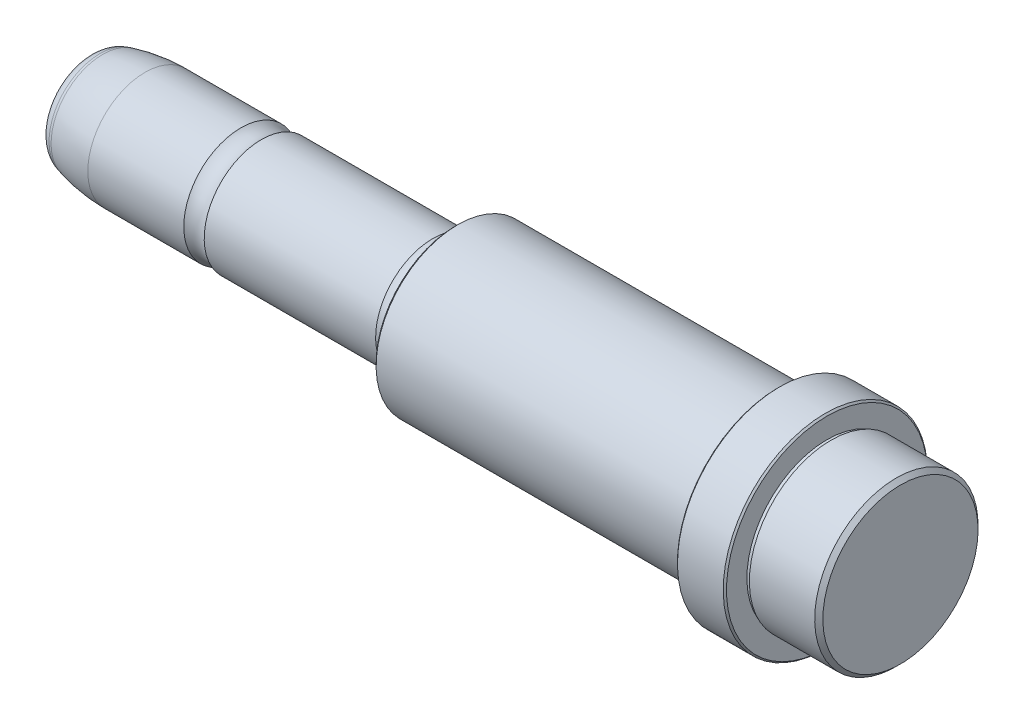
ISO-10303-21;
HEADER;
FILE_DESCRIPTION(('STEP AP214'),'2;1');
FILE_NAME('part.step','',(''),(''),'','','');
FILE_SCHEMA(('AUTOMOTIVE_DESIGN { 1 0 10303 214 1 1 1 1 }'));
ENDSEC;
DATA;
#1=APPLICATION_CONTEXT('core data for automotive mechanical design processes');
#2=APPLICATION_PROTOCOL_DEFINITION('international standard','automotive_design',2000,#1);
#3=PRODUCT_CONTEXT('',#1,'mechanical');
#4=PRODUCT('Part','Part','',(#3));
#5=PRODUCT_RELATED_PRODUCT_CATEGORY('part','',(#4));
#6=PRODUCT_DEFINITION_FORMATION('','',#4);
#7=PRODUCT_DEFINITION_CONTEXT('part definition',#1,'design');
#8=PRODUCT_DEFINITION('design','',#6,#7);
#9=PRODUCT_DEFINITION_SHAPE('','',#8);
#10=(LENGTH_UNIT() NAMED_UNIT(*) SI_UNIT(.MILLI.,.METRE.));
#11=(NAMED_UNIT(*) PLANE_ANGLE_UNIT() SI_UNIT($,.RADIAN.));
#12=(NAMED_UNIT(*) SI_UNIT($,.STERADIAN.) SOLID_ANGLE_UNIT());
#13=UNCERTAINTY_MEASURE_WITH_UNIT(LENGTH_MEASURE(1.E-05),#10,'distance_accuracy_value','');
#14=(GEOMETRIC_REPRESENTATION_CONTEXT(3) GLOBAL_UNCERTAINTY_ASSIGNED_CONTEXT((#13)) GLOBAL_UNIT_ASSIGNED_CONTEXT((#10,
#11,#12)) REPRESENTATION_CONTEXT('',''));
#15=CARTESIAN_POINT('',(0.,0.,0.));
#16=DIRECTION('',(0.,0.,1.));
#17=DIRECTION('',(1.,0.,0.));
#18=AXIS2_PLACEMENT_3D('',#15,#16,#17);
#19=CARTESIAN_POINT('',(54.7,64.75,78.));
#20=DIRECTION('',(1.,0.,0.));
#21=DIRECTION('',(0.,0.,-1.));
#22=AXIS2_PLACEMENT_3D('',#19,#20,#21);
#23=PLANE('',#22);
#24=CARTESIAN_POINT('',(54.7,60.,77.9999999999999));
#25=DIRECTION('',(1.,0.,0.));
#26=DIRECTION('',(0.,1.,0.));
#27=AXIS2_PLACEMENT_3D('',#24,#25,#26);
#28=CIRCLE('',#27,9.5);
#29=CARTESIAN_POINT('',(54.7,69.5,77.9999999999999));
#30=VERTEX_POINT('',#29);
#31=EDGE_CURVE('E8',#30,#30,#28,.T.);
#32=ORIENTED_EDGE('',*,*,#31,.T.);
#33=EDGE_LOOP('',(#32));
#34=FACE_BOUND('',#33,.T.);
#35=ADVANCED_FACE('F12',(#34),#23,.T.);
#36=DIRECTION('',(0.707106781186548,-0.707106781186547,0.));
#37=VECTOR('',#36,1.);
#38=CARTESIAN_POINT('',(54.45,69.75,78.));
#39=LINE('',#38,#37);
#40=CARTESIAN_POINT('',(64.2,60.,77.9999999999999));
#41=DIRECTION('',(-1.,0.,0.));
#42=AXIS1_PLACEMENT('',#40,#41);
#43=SURFACE_OF_REVOLUTION('',#39,#42);
#44=CARTESIAN_POINT('',(54.2,60.,77.9999999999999));
#45=DIRECTION('',(1.,0.,0.));
#46=DIRECTION('',(0.,1.,0.));
#47=AXIS2_PLACEMENT_3D('',#44,#45,#46);
#48=CIRCLE('',#47,10.);
#49=CARTESIAN_POINT('',(54.2,70.,77.9999999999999));
#50=VERTEX_POINT('',#49);
#51=EDGE_CURVE('E21',#50,#50,#48,.T.);
#52=ORIENTED_EDGE('',*,*,#51,.T.);
#53=EDGE_LOOP('',(#52));
#54=FACE_BOUND('',#53,.T.);
#55=ORIENTED_EDGE('',*,*,#31,.F.);
#56=EDGE_LOOP('',(#55));
#57=FACE_BOUND('',#56,.T.);
#58=ADVANCED_FACE('F102',(#54,#57),#43,.F.);
#59=CARTESIAN_POINT('',(50.2,60.,78.));
#60=DIRECTION('',(-1.,0.,0.));
#61=DIRECTION('',(0.,0.,1.));
#62=AXIS2_PLACEMENT_3D('',#59,#60,#61);
#63=CYLINDRICAL_SURFACE('',#62,10.);
#64=CARTESIAN_POINT('',(46.2,60.,78.));
#65=DIRECTION('',(1.,0.,0.));
#66=DIRECTION('',(0.,1.,0.));
#67=AXIS2_PLACEMENT_3D('',#64,#65,#66);
#68=CIRCLE('',#67,10.);
#69=CARTESIAN_POINT('',(46.2,70.,78.));
#70=VERTEX_POINT('',#69);
#71=EDGE_CURVE('E30',#70,#70,#68,.T.);
#72=ORIENTED_EDGE('',*,*,#71,.T.);
#73=EDGE_LOOP('',(#72));
#74=FACE_BOUND('',#73,.T.);
#75=ORIENTED_EDGE('',*,*,#51,.F.);
#76=EDGE_LOOP('',(#75));
#77=FACE_BOUND('',#76,.T.);
#78=ADVANCED_FACE('F106',(#74,#77),#63,.T.);
#79=CARTESIAN_POINT('',(46.2,69.9,78.));
#80=DIRECTION('',(-1.,0.,0.));
#81=DIRECTION('',(0.,0.,1.));
#82=AXIS2_PLACEMENT_3D('',#79,#80,#81);
#83=PLANE('',#82);
#84=CARTESIAN_POINT('',(46.2,60.,78.));
#85=DIRECTION('',(1.,0.,0.));
#86=DIRECTION('',(0.,1.,0.));
#87=AXIS2_PLACEMENT_3D('',#84,#85,#86);
#88=CIRCLE('',#87,9.8);
#89=CARTESIAN_POINT('',(46.2,69.8,78.));
#90=VERTEX_POINT('',#89);
#91=EDGE_CURVE('E34',#90,#90,#88,.T.);
#92=ORIENTED_EDGE('',*,*,#91,.T.);
#93=EDGE_LOOP('',(#92));
#94=FACE_BOUND('',#93,.T.);
#95=ORIENTED_EDGE('',*,*,#71,.F.);
#96=EDGE_LOOP('',(#95));
#97=FACE_BOUND('',#96,.T.);
#98=ADVANCED_FACE('F110',(#94,#97),#83,.T.);
#99=CARTESIAN_POINT('',(45.95,60.,78.));
#100=DIRECTION('',(-1.,0.,0.));
#101=DIRECTION('',(0.,0.,1.));
#102=AXIS2_PLACEMENT_3D('',#99,#100,#101);
#103=CYLINDRICAL_SURFACE('',#102,9.8);
#104=CARTESIAN_POINT('',(45.7,60.,78.));
#105=DIRECTION('',(1.,0.,0.));
#106=DIRECTION('',(0.,1.,0.));
#107=AXIS2_PLACEMENT_3D('',#104,#105,#106);
#108=CIRCLE('',#107,9.8);
#109=CARTESIAN_POINT('',(45.7,69.8,78.));
#110=VERTEX_POINT('',#109);
#111=EDGE_CURVE('E40',#110,#110,#108,.T.);
#112=ORIENTED_EDGE('',*,*,#111,.T.);
#113=EDGE_LOOP('',(#112));
#114=FACE_BOUND('',#113,.T.);
#115=ORIENTED_EDGE('',*,*,#91,.F.);
#116=EDGE_LOOP('',(#115));
#117=FACE_BOUND('',#116,.T.);
#118=ADVANCED_FACE('F114',(#114,#117),#103,.T.);
#119=CARTESIAN_POINT('',(45.7,71.05,78.));
#120=DIRECTION('',(1.,0.,0.));
#121=DIRECTION('',(0.,0.,-1.));
#122=AXIS2_PLACEMENT_3D('',#119,#120,#121);
#123=PLANE('',#122);
#124=CARTESIAN_POINT('',(45.7,60.,78.));
#125=DIRECTION('',(1.,0.,0.));
#126=DIRECTION('',(0.,1.,0.));
#127=AXIS2_PLACEMENT_3D('',#124,#125,#126);
#128=CIRCLE('',#127,12.3);
#129=CARTESIAN_POINT('',(45.7,72.3,78.));
#130=VERTEX_POINT('',#129);
#131=EDGE_CURVE('E36',#130,#130,#128,.T.);
#132=ORIENTED_EDGE('',*,*,#131,.T.);
#133=EDGE_LOOP('',(#132));
#134=FACE_BOUND('',#133,.T.);
#135=ORIENTED_EDGE('',*,*,#111,.F.);
#136=EDGE_LOOP('',(#135));
#137=FACE_BOUND('',#136,.T.);
#138=ADVANCED_FACE('F118',(#134,#137),#123,.T.);
#139=DIRECTION('',(0.707106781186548,-0.707106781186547,0.));
#140=VECTOR('',#139,1.);
#141=CARTESIAN_POINT('',(45.6,72.4,78.));
#142=LINE('',#141,#140);
#143=CARTESIAN_POINT('',(58.,60.,77.9999999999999));
#144=DIRECTION('',(-1.,0.,0.));
#145=AXIS1_PLACEMENT('',#143,#144);
#146=SURFACE_OF_REVOLUTION('',#142,#145);
#147=CARTESIAN_POINT('',(45.5,60.,78.));
#148=DIRECTION('',(1.,0.,0.));
#149=DIRECTION('',(0.,1.,0.));
#150=AXIS2_PLACEMENT_3D('',#147,#148,#149);
#151=CIRCLE('',#150,12.5);
#152=CARTESIAN_POINT('',(45.5,72.5,78.));
#153=VERTEX_POINT('',#152);
#154=EDGE_CURVE('E53',#153,#153,#151,.T.);
#155=ORIENTED_EDGE('',*,*,#154,.T.);
#156=EDGE_LOOP('',(#155));
#157=FACE_BOUND('',#156,.T.);
#158=ORIENTED_EDGE('',*,*,#131,.F.);
#159=EDGE_LOOP('',(#158));
#160=FACE_BOUND('',#159,.T.);
#161=ADVANCED_FACE('F122',(#157,#160),#146,.F.);
#162=CARTESIAN_POINT('',(42.7,60.,78.));
#163=DIRECTION('',(-1.,0.,0.));
#164=DIRECTION('',(0.,0.,1.));
#165=AXIS2_PLACEMENT_3D('',#162,#163,#164);
#166=CYLINDRICAL_SURFACE('',#165,12.5);
#167=CARTESIAN_POINT('',(39.9,60.,78.));
#168=DIRECTION('',(1.,0.,0.));
#169=DIRECTION('',(0.,1.,0.));
#170=AXIS2_PLACEMENT_3D('',#167,#168,#169);
#171=CIRCLE('',#170,12.5);
#172=CARTESIAN_POINT('',(39.9,72.5,78.));
#173=VERTEX_POINT('',#172);
#174=EDGE_CURVE('E57',#173,#173,#171,.T.);
#175=ORIENTED_EDGE('',*,*,#174,.T.);
#176=EDGE_LOOP('',(#175));
#177=FACE_BOUND('',#176,.T.);
#178=ORIENTED_EDGE('',*,*,#154,.F.);
#179=EDGE_LOOP('',(#178));
#180=FACE_BOUND('',#179,.T.);
#181=ADVANCED_FACE('F126',(#177,#180),#166,.T.);
#182=DIRECTION('',(-0.707106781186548,-0.707106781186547,0.));
#183=VECTOR('',#182,1.);
#184=CARTESIAN_POINT('',(39.8,72.4,78.));
#185=LINE('',#184,#183);
#186=CARTESIAN_POINT('',(27.4,60.,77.9999999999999));
#187=DIRECTION('',(1.,0.,0.));
#188=AXIS1_PLACEMENT('',#186,#187);
#189=SURFACE_OF_REVOLUTION('',#185,#188);
#190=CARTESIAN_POINT('',(39.7,60.,78.));
#191=DIRECTION('',(1.,0.,0.));
#192=DIRECTION('',(0.,1.,0.));
#193=AXIS2_PLACEMENT_3D('',#190,#191,#192);
#194=CIRCLE('',#193,12.3);
#195=CARTESIAN_POINT('',(39.7,72.3,78.));
#196=VERTEX_POINT('',#195);
#197=EDGE_CURVE('E41',#196,#196,#194,.T.);
#198=ORIENTED_EDGE('',*,*,#197,.T.);
#199=EDGE_LOOP('',(#198));
#200=FACE_BOUND('',#199,.T.);
#201=ORIENTED_EDGE('',*,*,#174,.F.);
#202=EDGE_LOOP('',(#201));
#203=FACE_BOUND('',#202,.T.);
#204=ADVANCED_FACE('F130',(#200,#203),#189,.F.);
#205=CARTESIAN_POINT('',(39.7,71.05,78.));
#206=DIRECTION('',(-1.,0.,0.));
#207=DIRECTION('',(0.,0.,1.));
#208=AXIS2_PLACEMENT_3D('',#205,#206,#207);
#209=PLANE('',#208);
#210=CARTESIAN_POINT('',(39.7,60.,78.));
#211=DIRECTION('',(1.,0.,0.));
#212=DIRECTION('',(0.,1.,0.));
#213=AXIS2_PLACEMENT_3D('',#210,#211,#212);
#214=CIRCLE('',#213,9.8);
#215=CARTESIAN_POINT('',(39.7,69.8,78.));
#216=VERTEX_POINT('',#215);
#217=EDGE_CURVE('E48',#216,#216,#214,.T.);
#218=ORIENTED_EDGE('',*,*,#217,.T.);
#219=EDGE_LOOP('',(#218));
#220=FACE_BOUND('',#219,.T.);
#221=ORIENTED_EDGE('',*,*,#197,.F.);
#222=EDGE_LOOP('',(#221));
#223=FACE_BOUND('',#222,.T.);
#224=ADVANCED_FACE('F134',(#220,#223),#209,.T.);
#225=CARTESIAN_POINT('',(39.45,60.,78.));
#226=DIRECTION('',(-1.,0.,0.));
#227=DIRECTION('',(0.,0.,1.));
#228=AXIS2_PLACEMENT_3D('',#225,#226,#227);
#229=CYLINDRICAL_SURFACE('',#228,9.8);
#230=CARTESIAN_POINT('',(39.2,60.,78.));
#231=DIRECTION('',(1.,0.,0.));
#232=DIRECTION('',(0.,1.,0.));
#233=AXIS2_PLACEMENT_3D('',#230,#231,#232);
#234=CIRCLE('',#233,9.8);
#235=CARTESIAN_POINT('',(39.2,69.8,78.));
#236=VERTEX_POINT('',#235);
#237=EDGE_CURVE('E52',#236,#236,#234,.T.);
#238=ORIENTED_EDGE('',*,*,#237,.T.);
#239=EDGE_LOOP('',(#238));
#240=FACE_BOUND('',#239,.T.);
#241=ORIENTED_EDGE('',*,*,#217,.F.);
#242=EDGE_LOOP('',(#241));
#243=FACE_BOUND('',#242,.T.);
#244=ADVANCED_FACE('F222',(#240,#243),#229,.T.);
#245=CARTESIAN_POINT('',(39.2,69.9,78.));
#246=DIRECTION('',(1.,0.,0.));
#247=DIRECTION('',(0.,0.,-1.));
#248=AXIS2_PLACEMENT_3D('',#245,#246,#247);
#249=PLANE('',#248);
#250=CARTESIAN_POINT('',(39.2,60.,78.));
#251=DIRECTION('',(1.,0.,0.));
#252=DIRECTION('',(0.,1.,0.));
#253=AXIS2_PLACEMENT_3D('',#250,#251,#252);
#254=CIRCLE('',#253,10.);
#255=CARTESIAN_POINT('',(39.2,70.,78.));
#256=VERTEX_POINT('',#255);
#257=EDGE_CURVE('E67',#256,#256,#254,.T.);
#258=ORIENTED_EDGE('',*,*,#257,.T.);
#259=EDGE_LOOP('',(#258));
#260=FACE_BOUND('',#259,.T.);
#261=ORIENTED_EDGE('',*,*,#237,.F.);
#262=EDGE_LOOP('',(#261));
#263=FACE_BOUND('',#262,.T.);
#264=ADVANCED_FACE('F228',(#260,#263),#249,.T.);
#265=CARTESIAN_POINT('',(20.7,60.,77.9999999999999));
#266=DIRECTION('',(-1.,0.,0.));
#267=DIRECTION('',(0.,0.,1.));
#268=AXIS2_PLACEMENT_3D('',#265,#266,#267);
#269=CYLINDRICAL_SURFACE('',#268,10.);
#270=CARTESIAN_POINT('',(0.5,60.,78.));
#271=DIRECTION('',(1.,0.,0.));
#272=DIRECTION('',(0.,1.,0.));
#273=AXIS2_PLACEMENT_3D('',#270,#271,#272);
#274=CIRCLE('',#273,10.);
#275=CARTESIAN_POINT('',(0.5,70.,78.));
#276=VERTEX_POINT('',#275);
#277=EDGE_CURVE('E77',#276,#276,#274,.T.);
#278=ORIENTED_EDGE('',*,*,#277,.T.);
#279=EDGE_LOOP('',(#278));
#280=FACE_BOUND('',#279,.T.);
#281=ORIENTED_EDGE('',*,*,#257,.F.);
#282=EDGE_LOOP('',(#281));
#283=FACE_BOUND('',#282,.T.);
#284=ADVANCED_FACE('F149',(#280,#283),#269,.T.);
#285=DIRECTION('',(-0.707106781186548,-0.707106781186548,0.));
#286=VECTOR('',#285,1.);
#287=CARTESIAN_POINT('',(0.350000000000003,69.85,78.));
#288=LINE('',#287,#286);
#289=CARTESIAN_POINT('',(-9.49999999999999,60.,78.));
#290=DIRECTION('',(1.,0.,0.));
#291=AXIS1_PLACEMENT('',#289,#290);
#292=SURFACE_OF_REVOLUTION('',#288,#291);
#293=CARTESIAN_POINT('',(0.200000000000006,60.,78.));
#294=DIRECTION('',(1.,0.,0.));
#295=DIRECTION('',(0.,1.,0.));
#296=AXIS2_PLACEMENT_3D('',#293,#294,#295);
#297=CIRCLE('',#296,9.7);
#298=CARTESIAN_POINT('',(0.200000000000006,69.7,78.));
#299=VERTEX_POINT('',#298);
#300=EDGE_CURVE('E87',#299,#299,#297,.T.);
#301=ORIENTED_EDGE('',*,*,#300,.T.);
#302=EDGE_LOOP('',(#301));
#303=FACE_BOUND('',#302,.T.);
#304=ORIENTED_EDGE('',*,*,#277,.F.);
#305=EDGE_LOOP('',(#304));
#306=FACE_BOUND('',#305,.T.);
#307=ADVANCED_FACE('F144',(#303,#306),#292,.F.);
#308=CARTESIAN_POINT('',(0.200000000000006,69.275,78.));
#309=DIRECTION('',(-1.,0.,0.));
#310=DIRECTION('',(0.,0.,1.));
#311=AXIS2_PLACEMENT_3D('',#308,#309,#310);
#312=PLANE('',#311);
#313=CARTESIAN_POINT('',(0.200000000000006,60.,78.));
#314=DIRECTION('',(1.,0.,0.));
#315=DIRECTION('',(0.,1.,0.));
#316=AXIS2_PLACEMENT_3D('',#313,#314,#315);
#317=CIRCLE('',#316,8.84999999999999);
#318=CARTESIAN_POINT('',(0.200000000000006,68.85,78.));
#319=VERTEX_POINT('',#318);
#320=EDGE_CURVE('E46',#319,#319,#317,.T.);
#321=ORIENTED_EDGE('',*,*,#320,.T.);
#322=EDGE_LOOP('',(#321));
#323=FACE_BOUND('',#322,.T.);
#324=ORIENTED_EDGE('',*,*,#300,.F.);
#325=EDGE_LOOP('',(#324));
#326=FACE_BOUND('',#325,.T.);
#327=ADVANCED_FACE('F148',(#323,#326),#312,.T.);
#328=CARTESIAN_POINT('',(-1.79999999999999,60.,78.));
#329=DIRECTION('',(1.,0.,0.));
#330=DIRECTION('',(0.,0.,-1.));
#331=AXIS2_PLACEMENT_3D('',#328,#329,#330);
#332=TOROIDAL_SURFACE('',#331,8.84999999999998,2.);
#333=ORIENTED_EDGE('',*,*,#320,.F.);
#334=EDGE_LOOP('',(#333));
#335=FACE_BOUND('',#334,.T.);
#336=CARTESIAN_POINT('',(-2.55993420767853,60.,78.));
#337=DIRECTION('',(1.,0.,0.));
#338=DIRECTION('',(0.,1.,0.));
#339=AXIS2_PLACEMENT_3D('',#336,#337,#338);
#340=CIRCLE('',#339,7.);
#341=CARTESIAN_POINT('',(-2.55993420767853,67.,78.));
#342=VERTEX_POINT('',#341);
#343=EDGE_CURVE('E42',#342,#342,#340,.T.);
#344=ORIENTED_EDGE('',*,*,#343,.T.);
#345=EDGE_LOOP('',(#344));
#346=FACE_BOUND('',#345,.T.);
#347=ADVANCED_FACE('F154',(#335,#346),#332,.F.);
#348=CARTESIAN_POINT('',(-13.0549671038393,60.,78.));
#349=DIRECTION('',(-1.,0.,0.));
#350=DIRECTION('',(0.,0.,1.));
#351=AXIS2_PLACEMENT_3D('',#348,#349,#350);
#352=CYLINDRICAL_SURFACE('',#351,7.);
#353=CARTESIAN_POINT('',(-23.55,60.,78.));
#354=DIRECTION('',(1.,0.,0.));
#355=DIRECTION('',(0.,1.,0.));
#356=AXIS2_PLACEMENT_3D('',#353,#354,#355);
#357=CIRCLE('',#356,7.);
#358=CARTESIAN_POINT('',(-23.55,67.,78.));
#359=VERTEX_POINT('',#358);
#360=EDGE_CURVE('E91',#359,#359,#357,.T.);
#361=ORIENTED_EDGE('',*,*,#360,.T.);
#362=EDGE_LOOP('',(#361));
#363=FACE_BOUND('',#362,.T.);
#364=ORIENTED_EDGE('',*,*,#343,.F.);
#365=EDGE_LOOP('',(#364));
#366=FACE_BOUND('',#365,.T.);
#367=ADVANCED_FACE('F158',(#363,#366),#352,.T.);
#368=CARTESIAN_POINT('',(-24.8,60.,78.));
#369=DIRECTION('',(1.,0.,0.));
#370=DIRECTION('',(0.,0.,-1.));
#371=AXIS2_PLACEMENT_3D('',#368,#369,#370);
#372=TOROIDAL_SURFACE('',#371,8.81038669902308,2.2);
#373=ORIENTED_EDGE('',*,*,#360,.F.);
#374=EDGE_LOOP('',(#373));
#375=FACE_BOUND('',#374,.T.);
#376=CARTESIAN_POINT('',(-26.05,60.,78.));
#377=DIRECTION('',(1.,0.,0.));
#378=DIRECTION('',(0.,1.,0.));
#379=AXIS2_PLACEMENT_3D('',#376,#377,#378);
#380=CIRCLE('',#379,7.);
#381=CARTESIAN_POINT('',(-26.05,67.,78.));
#382=VERTEX_POINT('',#381);
#383=EDGE_CURVE('E63',#382,#382,#380,.T.);
#384=ORIENTED_EDGE('',*,*,#383,.T.);
#385=EDGE_LOOP('',(#384));
#386=FACE_BOUND('',#385,.T.);
#387=ADVANCED_FACE('F162',(#375,#386),#372,.F.);
#388=CARTESIAN_POINT('',(-31.925,60.,78.));
#389=DIRECTION('',(-1.,0.,0.));
#390=DIRECTION('',(0.,0.,1.));
#391=AXIS2_PLACEMENT_3D('',#388,#389,#390);
#392=CYLINDRICAL_SURFACE('',#391,7.);
#393=CARTESIAN_POINT('',(-37.8,60.,78.));
#394=DIRECTION('',(1.,0.,0.));
#395=DIRECTION('',(0.,1.,0.));
#396=AXIS2_PLACEMENT_3D('',#393,#394,#395);
#397=CIRCLE('',#396,7.);
#398=CARTESIAN_POINT('',(-37.8,67.,78.));
#399=VERTEX_POINT('',#398);
#400=EDGE_CURVE('E47',#399,#399,#397,.T.);
#401=ORIENTED_EDGE('',*,*,#400,.T.);
#402=EDGE_LOOP('',(#401));
#403=FACE_BOUND('',#402,.T.);
#404=ORIENTED_EDGE('',*,*,#383,.F.);
#405=EDGE_LOOP('',(#404));
#406=FACE_BOUND('',#405,.T.);
#407=ADVANCED_FACE('F166',(#403,#406),#392,.T.);
#408=CARTESIAN_POINT('',(-37.8,60.,91.));
#409=DIRECTION('',(0.,1.,0.));
#410=DIRECTION('',(0.,0.,-1.));
#411=AXIS2_PLACEMENT_3D('',#408,#409,#410);
#412=CIRCLE('',#411,20.);
#413=TRIMMED_CURVE('',#412,(PARAMETER_VALUE(-0.863211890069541)),
(PARAMETER_VALUE(0.863211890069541)),.T.,.PARAMETER.);
#414=CARTESIAN_POINT('',(-37.8,60.,78.));
#415=DIRECTION('',(1.,0.,0.));
#416=AXIS1_PLACEMENT('',#414,#415);
#417=SURFACE_OF_REVOLUTION('',#413,#416);
#418=CARTESIAN_POINT('',(-42.9763809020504,60.,78.));
#419=DIRECTION('',(1.,0.,0.));
#420=DIRECTION('',(0.,1.,0.));
#421=AXIS2_PLACEMENT_3D('',#418,#419,#420);
#422=CIRCLE('',#421,6.31851652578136);
#423=CARTESIAN_POINT('',(-42.9763809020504,66.3185165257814,78.));
#424=VERTEX_POINT('',#423);
#425=EDGE_CURVE('E70',#424,#424,#422,.T.);
#426=ORIENTED_EDGE('',*,*,#425,.T.);
#427=EDGE_LOOP('',(#426));
#428=FACE_BOUND('',#427,.T.);
#429=ORIENTED_EDGE('',*,*,#400,.F.);
#430=EDGE_LOOP('',(#429));
#431=FACE_BOUND('',#430,.T.);
#432=ADVANCED_FACE('F173',(#428,#431),#417,.F.);
#433=DIRECTION('',(-0.965925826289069,-0.258819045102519,0.));
#434=VECTOR('',#433,1.);
#435=CARTESIAN_POINT('',(499000.,133784.481026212,78.0000000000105));
#436=LINE('',#435,#434);
#437=CARTESIAN_POINT('',(-66.5574056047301,60.,78.));
#438=DIRECTION('',(1.,0.,0.));
#439=AXIS1_PLACEMENT('',#437,#438);
#440=SURFACE_OF_REVOLUTION('',#436,#439);
#441=CARTESIAN_POINT('',(-43.317638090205,60.,78.));
#442=DIRECTION('',(1.,0.,0.));
#443=DIRECTION('',(0.,1.,0.));
#444=AXIS2_PLACEMENT_3D('',#441,#442,#443);
#445=CIRCLE('',#444,6.22707693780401);
#446=CARTESIAN_POINT('',(-43.317638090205,66.227076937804,78.));
#447=VERTEX_POINT('',#446);
#448=EDGE_CURVE('E58',#447,#447,#445,.T.);
#449=ORIENTED_EDGE('',*,*,#448,.T.);
#450=EDGE_LOOP('',(#449));
#451=FACE_BOUND('',#450,.T.);
#452=ORIENTED_EDGE('',*,*,#425,.F.);
#453=EDGE_LOOP('',(#452));
#454=FACE_BOUND('',#453,.T.);
#455=ADVANCED_FACE('F176',(#451,#454),#440,.F.);
#456=CARTESIAN_POINT('',(-42.8,60.,78.));
#457=DIRECTION('',(1.,0.,0.));
#458=DIRECTION('',(0.,0.,-1.));
#459=AXIS2_PLACEMENT_3D('',#456,#457,#458);
#460=TOROIDAL_SURFACE('',#459,4.29522528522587,2.);
#461=CARTESIAN_POINT('',(-44.8,60.,78.));
#462=DIRECTION('',(1.,0.,0.));
#463=DIRECTION('',(0.,1.,0.));
#464=AXIS2_PLACEMENT_3D('',#461,#462,#463);
#465=CIRCLE('',#464,4.29522528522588);
#466=CARTESIAN_POINT('',(-44.8,64.2952252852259,78.));
#467=VERTEX_POINT('',#466);
#468=EDGE_CURVE('E62',#467,#467,#465,.T.);
#469=ORIENTED_EDGE('',*,*,#468,.T.);
#470=EDGE_LOOP('',(#469));
#471=FACE_BOUND('',#470,.T.);
#472=ORIENTED_EDGE('',*,*,#448,.F.);
#473=EDGE_LOOP('',(#472));
#474=FACE_BOUND('',#473,.T.);
#475=ADVANCED_FACE('F179',(#471,#474),#460,.T.);
#476=CARTESIAN_POINT('',(-44.8,62.1476126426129,78.));
#477=DIRECTION('',(-1.,0.,0.));
#478=DIRECTION('',(0.,0.,1.));
#479=AXIS2_PLACEMENT_3D('',#476,#477,#478);
#480=PLANE('',#479);
#481=ORIENTED_EDGE('',*,*,#468,.F.);
#482=EDGE_LOOP('',(#481));
#483=FACE_BOUND('',#482,.T.);
#484=ADVANCED_FACE('F14',(#483),#480,.T.);
#485=CLOSED_SHELL('',(#35,#58,#78,#98,#118,#138,#161,#181,#204,#224,#244,#264,#284,#307,#327,
#347,#367,#387,#407,#432,#455,#475,#484));
#486=MANIFOLD_SOLID_BREP('B1',#485);
#487=ADVANCED_BREP_SHAPE_REPRESENTATION('',(#18,#486),#14);
#488=SHAPE_DEFINITION_REPRESENTATION(#9,#487);
ENDSEC;
END-ISO-10303-21;
